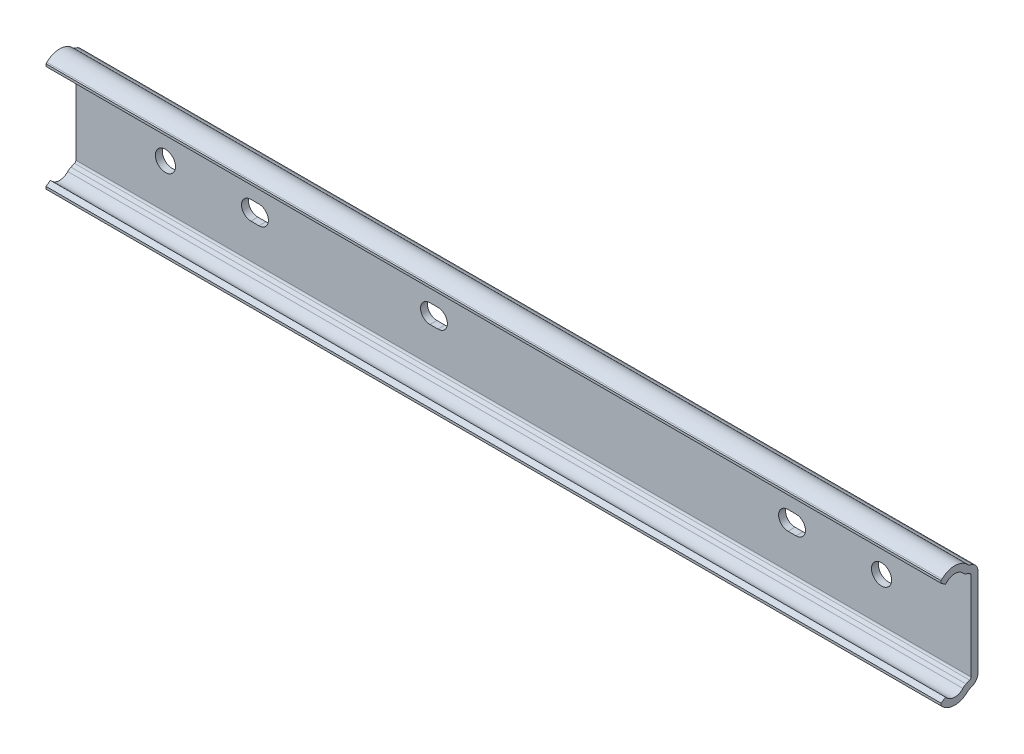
ISO-10303-21;
HEADER;
FILE_DESCRIPTION(('STEP AP214'),'2;1');
FILE_NAME('part.step','',(''),(''),'','','');
FILE_SCHEMA(('AUTOMOTIVE_DESIGN { 1 0 10303 214 1 1 1 1 }'));
ENDSEC;
DATA;
#1=APPLICATION_CONTEXT('core data for automotive mechanical design processes');
#2=APPLICATION_PROTOCOL_DEFINITION('international standard','automotive_design',2000,#1);
#3=PRODUCT_CONTEXT('',#1,'mechanical');
#4=PRODUCT('Part','Part','',(#3));
#5=PRODUCT_RELATED_PRODUCT_CATEGORY('part','',(#4));
#6=PRODUCT_DEFINITION_FORMATION('','',#4);
#7=PRODUCT_DEFINITION_CONTEXT('part definition',#1,'design');
#8=PRODUCT_DEFINITION('design','',#6,#7);
#9=PRODUCT_DEFINITION_SHAPE('','',#8);
#10=(LENGTH_UNIT() NAMED_UNIT(*) SI_UNIT(.MILLI.,.METRE.));
#11=(NAMED_UNIT(*) PLANE_ANGLE_UNIT() SI_UNIT($,.RADIAN.));
#12=(NAMED_UNIT(*) SI_UNIT($,.STERADIAN.) SOLID_ANGLE_UNIT());
#13=UNCERTAINTY_MEASURE_WITH_UNIT(LENGTH_MEASURE(1.E-05),#10,'distance_accuracy_value','');
#14=(GEOMETRIC_REPRESENTATION_CONTEXT(3) GLOBAL_UNCERTAINTY_ASSIGNED_CONTEXT((#13)) GLOBAL_UNIT_ASSIGNED_CONTEXT((#10,
#11,#12)) REPRESENTATION_CONTEXT('',''));
#15=CARTESIAN_POINT('',(0.,0.,0.));
#16=DIRECTION('',(0.,0.,1.));
#17=DIRECTION('',(1.,0.,0.));
#18=AXIS2_PLACEMENT_3D('',#15,#16,#17);
#19=CARTESIAN_POINT('',(-20.,9.85313395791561,1.54999999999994));
#20=DIRECTION('',(0.,0.,1.));
#21=DIRECTION('',(-1.,0.,0.));
#22=AXIS2_PLACEMENT_3D('',#19,#20,#21);
#23=PLANE('',#22);
#24=DIRECTION('',(0.,-1.,0.));
#25=VECTOR('',#24,1.);
#26=CARTESIAN_POINT('',(-20.,9.85313395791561,1.54999999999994));
#27=LINE('',#26,#25);
#28=CARTESIAN_POINT('',(-20.,9.85313395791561,1.54999999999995));
#29=VERTEX_POINT('',#28);
#30=CARTESIAN_POINT('',(-20.,-9.85313395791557,1.54999999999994));
#31=VERTEX_POINT('',#30);
#32=EDGE_CURVE('E510',#29,#31,#27,.T.);
#33=ORIENTED_EDGE('',*,*,#32,.T.);
#34=DIRECTION('',(1.,0.,0.));
#35=VECTOR('',#34,1.);
#36=CARTESIAN_POINT('',(-20.,-9.85313395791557,1.54999999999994));
#37=LINE('',#36,#35);
#38=CARTESIAN_POINT('',(180.,-9.85313395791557,1.54999999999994));
#39=VERTEX_POINT('',#38);
#40=EDGE_CURVE('E524',#31,#39,#37,.T.);
#41=ORIENTED_EDGE('',*,*,#40,.T.);
#42=DIRECTION('',(0.,-1.,0.));
#43=VECTOR('',#42,1.);
#44=CARTESIAN_POINT('',(180.,9.85313395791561,1.54999999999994));
#45=LINE('',#44,#43);
#46=CARTESIAN_POINT('',(180.,9.85313395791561,1.54999999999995));
#47=VERTEX_POINT('',#46);
#48=EDGE_CURVE('E435',#47,#39,#45,.T.);
#49=ORIENTED_EDGE('',*,*,#48,.F.);
#50=DIRECTION('',(1.,0.,0.));
#51=VECTOR('',#50,1.);
#52=CARTESIAN_POINT('',(-20.,9.85313395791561,1.54999999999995));
#53=LINE('',#52,#51);
#54=EDGE_CURVE('E526',#29,#47,#53,.T.);
#55=ORIENTED_EDGE('',*,*,#54,.F.);
#56=EDGE_LOOP('',(#33,#41,#49,#55));
#57=FACE_BOUND('',#56,.T.);
#58=CARTESIAN_POINT('',(20.9,0.,1.54999999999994));
#59=DIRECTION('',(0.,0.,1.));
#60=DIRECTION('',(-1.,0.,0.));
#61=AXIS2_PLACEMENT_3D('',#58,#59,#60);
#62=CIRCLE('',#61,2.1);
#63=CARTESIAN_POINT('',(20.9,-2.1,1.54999999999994));
#64=VERTEX_POINT('',#63);
#65=CARTESIAN_POINT('',(20.9,2.1,1.54999999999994));
#66=VERTEX_POINT('',#65);
#67=EDGE_CURVE('E31',#64,#66,#62,.T.);
#68=ORIENTED_EDGE('',*,*,#67,.F.);
#69=DIRECTION('',(1.,0.,0.));
#70=VECTOR('',#69,1.);
#71=CARTESIAN_POINT('',(20.9,-2.1,1.54999999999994));
#72=LINE('',#71,#70);
#73=CARTESIAN_POINT('',(19.1,-2.1,1.54999999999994));
#74=VERTEX_POINT('',#73);
#75=EDGE_CURVE('E277',#74,#64,#72,.T.);
#76=ORIENTED_EDGE('',*,*,#75,.F.);
#77=CARTESIAN_POINT('',(19.1,0.,1.54999999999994));
#78=DIRECTION('',(0.,0.,1.));
#79=DIRECTION('',(-1.,0.,0.));
#80=AXIS2_PLACEMENT_3D('',#77,#78,#79);
#81=CIRCLE('',#80,2.1);
#82=CARTESIAN_POINT('',(19.1,2.1,1.54999999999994));
#83=VERTEX_POINT('',#82);
#84=EDGE_CURVE('E262',#83,#74,#81,.T.);
#85=ORIENTED_EDGE('',*,*,#84,.F.);
#86=DIRECTION('',(-1.,0.,0.));
#87=VECTOR('',#86,1.);
#88=CARTESIAN_POINT('',(20.9,2.1,1.54999999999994));
#89=LINE('',#88,#87);
#90=EDGE_CURVE('E271',#66,#83,#89,.T.);
#91=ORIENTED_EDGE('',*,*,#90,.F.);
#92=EDGE_LOOP('',(#68,#76,#85,#91));
#93=FACE_BOUND('',#92,.T.);
#94=CARTESIAN_POINT('',(60.9,0.,1.54999999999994));
#95=DIRECTION('',(0.,0.,1.));
#96=DIRECTION('',(-1.,0.,0.));
#97=AXIS2_PLACEMENT_3D('',#94,#95,#96);
#98=CIRCLE('',#97,2.1);
#99=CARTESIAN_POINT('',(60.9,-2.1,1.54999999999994));
#100=VERTEX_POINT('',#99);
#101=CARTESIAN_POINT('',(60.9,2.1,1.54999999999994));
#102=VERTEX_POINT('',#101);
#103=EDGE_CURVE('E293',#100,#102,#98,.T.);
#104=ORIENTED_EDGE('',*,*,#103,.F.);
#105=DIRECTION('',(1.,0.,0.));
#106=VECTOR('',#105,1.);
#107=CARTESIAN_POINT('',(60.9,-2.1,1.54999999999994));
#108=LINE('',#107,#106);
#109=CARTESIAN_POINT('',(59.1,-2.1,1.54999999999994));
#110=VERTEX_POINT('',#109);
#111=EDGE_CURVE('E303',#110,#100,#108,.T.);
#112=ORIENTED_EDGE('',*,*,#111,.F.);
#113=CARTESIAN_POINT('',(59.1,0.,1.54999999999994));
#114=DIRECTION('',(0.,0.,1.));
#115=DIRECTION('',(-1.,0.,0.));
#116=AXIS2_PLACEMENT_3D('',#113,#114,#115);
#117=CIRCLE('',#116,2.1);
#118=CARTESIAN_POINT('',(59.1,2.1,1.54999999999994));
#119=VERTEX_POINT('',#118);
#120=EDGE_CURVE('E300',#119,#110,#117,.T.);
#121=ORIENTED_EDGE('',*,*,#120,.F.);
#122=DIRECTION('',(-1.,0.,0.));
#123=VECTOR('',#122,1.);
#124=CARTESIAN_POINT('',(60.9,2.1,1.54999999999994));
#125=LINE('',#124,#123);
#126=EDGE_CURVE('E297',#102,#119,#125,.T.);
#127=ORIENTED_EDGE('',*,*,#126,.F.);
#128=EDGE_LOOP('',(#104,#112,#121,#127));
#129=FACE_BOUND('',#128,.T.);
#130=CARTESIAN_POINT('',(160.,0.,1.54999999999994));
#131=DIRECTION('',(0.,0.,1.));
#132=DIRECTION('',(-1.,0.,0.));
#133=AXIS2_PLACEMENT_3D('',#130,#131,#132);
#134=CIRCLE('',#133,2.24999999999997);
#135=CARTESIAN_POINT('',(157.75,0.,1.54999999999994));
#136=VERTEX_POINT('',#135);
#137=EDGE_CURVE('E321',#136,#136,#134,.T.);
#138=ORIENTED_EDGE('',*,*,#137,.F.);
#139=EDGE_LOOP('',(#138));
#140=FACE_BOUND('',#139,.T.);
#141=CARTESIAN_POINT('',(0.,0.,1.54999999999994));
#142=DIRECTION('',(0.,0.,1.));
#143=DIRECTION('',(-1.,0.,0.));
#144=AXIS2_PLACEMENT_3D('',#141,#142,#143);
#145=CIRCLE('',#144,2.25);
#146=CARTESIAN_POINT('',(-2.25,0.,1.54999999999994));
#147=VERTEX_POINT('',#146);
#148=EDGE_CURVE('E333',#147,#147,#145,.T.);
#149=ORIENTED_EDGE('',*,*,#148,.F.);
#150=EDGE_LOOP('',(#149));
#151=FACE_BOUND('',#150,.T.);
#152=CARTESIAN_POINT('',(139.1,0.,1.54999999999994));
#153=DIRECTION('',(0.,0.,1.));
#154=DIRECTION('',(-1.,0.,0.));
#155=AXIS2_PLACEMENT_3D('',#152,#153,#154);
#156=CIRCLE('',#155,2.1);
#157=CARTESIAN_POINT('',(139.1,2.1,1.54999999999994));
#158=VERTEX_POINT('',#157);
#159=CARTESIAN_POINT('',(139.1,-2.1,1.54999999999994));
#160=VERTEX_POINT('',#159);
#161=EDGE_CURVE('E339',#158,#160,#156,.T.);
#162=ORIENTED_EDGE('',*,*,#161,.F.);
#163=DIRECTION('',(-1.,0.,0.));
#164=VECTOR('',#163,1.);
#165=CARTESIAN_POINT('',(140.9,2.1,1.54999999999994));
#166=LINE('',#165,#164);
#167=CARTESIAN_POINT('',(140.9,2.1,1.54999999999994));
#168=VERTEX_POINT('',#167);
#169=EDGE_CURVE('E347',#168,#158,#166,.T.);
#170=ORIENTED_EDGE('',*,*,#169,.F.);
#171=CARTESIAN_POINT('',(140.9,0.,1.54999999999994));
#172=DIRECTION('',(0.,0.,1.));
#173=DIRECTION('',(-1.,0.,0.));
#174=AXIS2_PLACEMENT_3D('',#171,#172,#173);
#175=CIRCLE('',#174,2.1);
#176=CARTESIAN_POINT('',(140.9,-2.1,1.54999999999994));
#177=VERTEX_POINT('',#176);
#178=EDGE_CURVE('E344',#177,#168,#175,.T.);
#179=ORIENTED_EDGE('',*,*,#178,.F.);
#180=DIRECTION('',(1.,0.,0.));
#181=VECTOR('',#180,1.);
#182=CARTESIAN_POINT('',(140.9,-2.1,1.54999999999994));
#183=LINE('',#182,#181);
#184=EDGE_CURVE('E341',#160,#177,#183,.T.);
#185=ORIENTED_EDGE('',*,*,#184,.F.);
#186=EDGE_LOOP('',(#162,#170,#179,#185));
#187=FACE_BOUND('',#186,.T.);
#188=ADVANCED_FACE('F14',(#57,#93,#129,#140,#151,#187),#23,.T.);
#189=CARTESIAN_POINT('',(-20.,9.85313395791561,0.));
#190=DIRECTION('',(0.,0.,-1.));
#191=DIRECTION('',(1.,0.,0.));
#192=AXIS2_PLACEMENT_3D('',#189,#190,#191);
#193=PLANE('',#192);
#194=DIRECTION('',(0.,1.,0.));
#195=VECTOR('',#194,1.);
#196=CARTESIAN_POINT('',(-20.,9.85313395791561,0.));
#197=LINE('',#196,#195);
#198=CARTESIAN_POINT('',(-20.,-9.85313395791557,0.));
#199=VERTEX_POINT('',#198);
#200=CARTESIAN_POINT('',(-20.,9.85313395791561,0.));
#201=VERTEX_POINT('',#200);
#202=EDGE_CURVE('E473',#199,#201,#197,.T.);
#203=ORIENTED_EDGE('',*,*,#202,.T.);
#204=DIRECTION('',(1.,0.,0.));
#205=VECTOR('',#204,1.);
#206=CARTESIAN_POINT('',(-20.,9.85313395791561,0.));
#207=LINE('',#206,#205);
#208=CARTESIAN_POINT('',(180.,9.85313395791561,0.));
#209=VERTEX_POINT('',#208);
#210=EDGE_CURVE('E551',#201,#209,#207,.T.);
#211=ORIENTED_EDGE('',*,*,#210,.T.);
#212=DIRECTION('',(0.,1.,0.));
#213=VECTOR('',#212,1.);
#214=CARTESIAN_POINT('',(180.,9.85313395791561,0.));
#215=LINE('',#214,#213);
#216=CARTESIAN_POINT('',(180.,-9.85313395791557,0.));
#217=VERTEX_POINT('',#216);
#218=EDGE_CURVE('E397',#217,#209,#215,.T.);
#219=ORIENTED_EDGE('',*,*,#218,.F.);
#220=DIRECTION('',(1.,0.,0.));
#221=VECTOR('',#220,1.);
#222=CARTESIAN_POINT('',(-20.,-9.85313395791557,0.));
#223=LINE('',#222,#221);
#224=EDGE_CURVE('E553',#199,#217,#223,.T.);
#225=ORIENTED_EDGE('',*,*,#224,.F.);
#226=EDGE_LOOP('',(#203,#211,#219,#225));
#227=FACE_BOUND('',#226,.T.);
#228=CARTESIAN_POINT('',(20.9,0.,0.));
#229=DIRECTION('',(0.,0.,1.));
#230=DIRECTION('',(-1.,0.,0.));
#231=AXIS2_PLACEMENT_3D('',#228,#229,#230);
#232=CIRCLE('',#231,2.1);
#233=CARTESIAN_POINT('',(20.9,-2.1,0.));
#234=VERTEX_POINT('',#233);
#235=CARTESIAN_POINT('',(20.9,2.1,0.));
#236=VERTEX_POINT('',#235);
#237=EDGE_CURVE('E279',#234,#236,#232,.T.);
#238=ORIENTED_EDGE('',*,*,#237,.T.);
#239=DIRECTION('',(-1.,0.,0.));
#240=VECTOR('',#239,1.);
#241=CARTESIAN_POINT('',(20.9,2.1,0.));
#242=LINE('',#241,#240);
#243=CARTESIAN_POINT('',(19.1,2.1,0.));
#244=VERTEX_POINT('',#243);
#245=EDGE_CURVE('E285',#236,#244,#242,.T.);
#246=ORIENTED_EDGE('',*,*,#245,.T.);
#247=CARTESIAN_POINT('',(19.1,0.,0.));
#248=DIRECTION('',(0.,0.,1.));
#249=DIRECTION('',(-1.,0.,0.));
#250=AXIS2_PLACEMENT_3D('',#247,#248,#249);
#251=CIRCLE('',#250,2.1);
#252=CARTESIAN_POINT('',(19.1,-2.1,0.));
#253=VERTEX_POINT('',#252);
#254=EDGE_CURVE('E39',#244,#253,#251,.T.);
#255=ORIENTED_EDGE('',*,*,#254,.T.);
#256=DIRECTION('',(1.,0.,0.));
#257=VECTOR('',#256,1.);
#258=CARTESIAN_POINT('',(20.9,-2.1,0.));
#259=LINE('',#258,#257);
#260=EDGE_CURVE('E288',#253,#234,#259,.T.);
#261=ORIENTED_EDGE('',*,*,#260,.T.);
#262=EDGE_LOOP('',(#238,#246,#255,#261));
#263=FACE_BOUND('',#262,.T.);
#264=CARTESIAN_POINT('',(60.9,0.,0.));
#265=DIRECTION('',(0.,0.,1.));
#266=DIRECTION('',(-1.,0.,0.));
#267=AXIS2_PLACEMENT_3D('',#264,#265,#266);
#268=CIRCLE('',#267,2.1);
#269=CARTESIAN_POINT('',(60.9,-2.1,0.));
#270=VERTEX_POINT('',#269);
#271=CARTESIAN_POINT('',(60.9,2.1,0.));
#272=VERTEX_POINT('',#271);
#273=EDGE_CURVE('E306',#270,#272,#268,.T.);
#274=ORIENTED_EDGE('',*,*,#273,.T.);
#275=DIRECTION('',(-1.,0.,0.));
#276=VECTOR('',#275,1.);
#277=CARTESIAN_POINT('',(60.9,2.1,0.));
#278=LINE('',#277,#276);
#279=CARTESIAN_POINT('',(59.1,2.1,0.));
#280=VERTEX_POINT('',#279);
#281=EDGE_CURVE('E309',#272,#280,#278,.T.);
#282=ORIENTED_EDGE('',*,*,#281,.T.);
#283=CARTESIAN_POINT('',(59.1,0.,0.));
#284=DIRECTION('',(0.,0.,1.));
#285=DIRECTION('',(-1.,0.,0.));
#286=AXIS2_PLACEMENT_3D('',#283,#284,#285);
#287=CIRCLE('',#286,2.1);
#288=CARTESIAN_POINT('',(59.1,-2.1,0.));
#289=VERTEX_POINT('',#288);
#290=EDGE_CURVE('E312',#280,#289,#287,.T.);
#291=ORIENTED_EDGE('',*,*,#290,.T.);
#292=DIRECTION('',(1.,0.,0.));
#293=VECTOR('',#292,1.);
#294=CARTESIAN_POINT('',(60.9,-2.1,0.));
#295=LINE('',#294,#293);
#296=EDGE_CURVE('E315',#289,#270,#295,.T.);
#297=ORIENTED_EDGE('',*,*,#296,.T.);
#298=EDGE_LOOP('',(#274,#282,#291,#297));
#299=FACE_BOUND('',#298,.T.);
#300=CARTESIAN_POINT('',(160.,0.,0.));
#301=DIRECTION('',(0.,0.,1.));
#302=DIRECTION('',(-1.,0.,0.));
#303=AXIS2_PLACEMENT_3D('',#300,#301,#302);
#304=CIRCLE('',#303,2.24999999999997);
#305=CARTESIAN_POINT('',(157.75,0.,0.));
#306=VERTEX_POINT('',#305);
#307=EDGE_CURVE('E330',#306,#306,#304,.T.);
#308=ORIENTED_EDGE('',*,*,#307,.T.);
#309=EDGE_LOOP('',(#308));
#310=FACE_BOUND('',#309,.T.);
#311=CARTESIAN_POINT('',(0.,0.,0.));
#312=DIRECTION('',(0.,0.,1.));
#313=DIRECTION('',(-1.,0.,0.));
#314=AXIS2_PLACEMENT_3D('',#311,#312,#313);
#315=CIRCLE('',#314,2.25);
#316=CARTESIAN_POINT('',(-2.25,0.,0.));
#317=VERTEX_POINT('',#316);
#318=EDGE_CURVE('E336',#317,#317,#315,.T.);
#319=ORIENTED_EDGE('',*,*,#318,.T.);
#320=EDGE_LOOP('',(#319));
#321=FACE_BOUND('',#320,.T.);
#322=CARTESIAN_POINT('',(139.1,0.,0.));
#323=DIRECTION('',(0.,0.,1.));
#324=DIRECTION('',(-1.,0.,0.));
#325=AXIS2_PLACEMENT_3D('',#322,#323,#324);
#326=CIRCLE('',#325,2.1);
#327=CARTESIAN_POINT('',(139.1,2.1,0.));
#328=VERTEX_POINT('',#327);
#329=CARTESIAN_POINT('',(139.1,-2.1,0.));
#330=VERTEX_POINT('',#329);
#331=EDGE_CURVE('E350',#328,#330,#326,.T.);
#332=ORIENTED_EDGE('',*,*,#331,.T.);
#333=DIRECTION('',(1.,0.,0.));
#334=VECTOR('',#333,1.);
#335=CARTESIAN_POINT('',(140.9,-2.1,0.));
#336=LINE('',#335,#334);
#337=CARTESIAN_POINT('',(140.9,-2.1,0.));
#338=VERTEX_POINT('',#337);
#339=EDGE_CURVE('E353',#330,#338,#336,.T.);
#340=ORIENTED_EDGE('',*,*,#339,.T.);
#341=CARTESIAN_POINT('',(140.9,0.,0.));
#342=DIRECTION('',(0.,0.,1.));
#343=DIRECTION('',(-1.,0.,0.));
#344=AXIS2_PLACEMENT_3D('',#341,#342,#343);
#345=CIRCLE('',#344,2.1);
#346=CARTESIAN_POINT('',(140.9,2.1,0.));
#347=VERTEX_POINT('',#346);
#348=EDGE_CURVE('E356',#338,#347,#345,.T.);
#349=ORIENTED_EDGE('',*,*,#348,.T.);
#350=DIRECTION('',(-1.,0.,0.));
#351=VECTOR('',#350,1.);
#352=CARTESIAN_POINT('',(140.9,2.1,0.));
#353=LINE('',#352,#351);
#354=EDGE_CURVE('E359',#347,#328,#353,.T.);
#355=ORIENTED_EDGE('',*,*,#354,.T.);
#356=EDGE_LOOP('',(#332,#340,#349,#355));
#357=FACE_BOUND('',#356,.T.);
#358=ADVANCED_FACE('F618',(#227,#263,#299,#310,#321,#357),#193,.T.);
#359=CARTESIAN_POINT('',(-20.,-9.46999976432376,5.19000022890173));
#360=DIRECTION('',(1.,0.,0.));
#361=DIRECTION('',(0.,0.,1.));
#362=AXIS2_PLACEMENT_3D('',#359,#360,#361);
#363=CYLINDRICAL_SURFACE('',#362,2.47999999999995);
#364=CARTESIAN_POINT('',(180.,-9.46999976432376,5.19000022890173));
#365=DIRECTION('',(-1.,0.,0.));
#366=DIRECTION('',(0.,0.,1.));
#367=AXIS2_PLACEMENT_3D('',#364,#365,#366);
#368=CIRCLE('',#367,2.47999999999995);
#369=CARTESIAN_POINT('',(180.,-11.1527317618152,3.3682392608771));
#370=VERTEX_POINT('',#369);
#371=CARTESIAN_POINT('',(180.,-11.2236245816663,6.94362504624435));
#372=VERTEX_POINT('',#371);
#373=EDGE_CURVE('E365',#370,#372,#368,.T.);
#374=ORIENTED_EDGE('',*,*,#373,.F.);
#375=DIRECTION('',(1.,0.,0.));
#376=VECTOR('',#375,1.);
#377=CARTESIAN_POINT('',(-20.,-11.1527317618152,3.3682392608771));
#378=LINE('',#377,#376);
#379=CARTESIAN_POINT('',(-20.,-11.1527317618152,3.3682392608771));
#380=VERTEX_POINT('',#379);
#381=EDGE_CURVE('E9',#380,#370,#378,.T.);
#382=ORIENTED_EDGE('',*,*,#381,.F.);
#383=CARTESIAN_POINT('',(-20.,-9.46999976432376,5.19000022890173));
#384=DIRECTION('',(-1.,0.,0.));
#385=DIRECTION('',(0.,0.,1.));
#386=AXIS2_PLACEMENT_3D('',#383,#384,#385);
#387=CIRCLE('',#386,2.47999999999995);
#388=CARTESIAN_POINT('',(-20.,-11.2236245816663,6.94362504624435));
#389=VERTEX_POINT('',#388);
#390=EDGE_CURVE('E447',#380,#389,#387,.T.);
#391=ORIENTED_EDGE('',*,*,#390,.T.);
#392=DIRECTION('',(1.,0.,0.));
#393=VECTOR('',#392,1.);
#394=CARTESIAN_POINT('',(-20.,-11.2236245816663,6.94362504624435));
#395=LINE('',#394,#393);
#396=EDGE_CURVE('E18',#389,#372,#395,.T.);
#397=ORIENTED_EDGE('',*,*,#396,.T.);
#398=EDGE_LOOP('',(#374,#382,#391,#397));
#399=FACE_BOUND('',#398,.T.);
#400=ADVANCED_FACE('F16',(#399),#363,.F.);
#401=CARTESIAN_POINT('',(-20.,-12.5436997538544,1.86234824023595));
#402=DIRECTION('',(1.,0.,0.));
#403=DIRECTION('',(0.,0.,1.));
#404=AXIS2_PLACEMENT_3D('',#401,#402,#403);
#405=CYLINDRICAL_SURFACE('',#404,2.04999993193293);
#406=CARTESIAN_POINT('',(180.,-12.5436997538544,1.86234824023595));
#407=DIRECTION('',(1.,0.,0.));
#408=DIRECTION('',(0.,0.,1.));
#409=AXIS2_PLACEMENT_3D('',#406,#407,#408);
#410=CIRCLE('',#409,2.04999993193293);
#411=CARTESIAN_POINT('',(180.,-10.6566648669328,2.66334702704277));
#412=VERTEX_POINT('',#411);
#413=EDGE_CURVE('E444',#412,#370,#410,.T.);
#414=ORIENTED_EDGE('',*,*,#413,.F.);
#415=DIRECTION('',(1.,0.,0.));
#416=VECTOR('',#415,1.);
#417=CARTESIAN_POINT('',(-20.,-10.6566648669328,2.66334702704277));
#418=LINE('',#417,#416);
#419=CARTESIAN_POINT('',(-20.,-10.6566648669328,2.66334702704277));
#420=VERTEX_POINT('',#419);
#421=EDGE_CURVE('E23',#420,#412,#418,.T.);
#422=ORIENTED_EDGE('',*,*,#421,.F.);
#423=CARTESIAN_POINT('',(-20.,-12.5436997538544,1.86234824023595));
#424=DIRECTION('',(1.,0.,0.));
#425=DIRECTION('',(0.,0.,1.));
#426=AXIS2_PLACEMENT_3D('',#423,#424,#425);
#427=CIRCLE('',#426,2.04999993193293);
#428=EDGE_CURVE('E518',#420,#380,#427,.T.);
#429=ORIENTED_EDGE('',*,*,#428,.T.);
#430=ORIENTED_EDGE('',*,*,#381,.T.);
#431=EDGE_LOOP('',(#414,#422,#429,#430));
#432=FACE_BOUND('',#431,.T.);
#433=ADVANCED_FACE('F581',(#432),#405,.T.);
#434=CARTESIAN_POINT('',(-20.,-10.6566648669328,2.66334702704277));
#435=DIRECTION('',(0.,0.920504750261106,0.390731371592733));
#436=DIRECTION('',(0.,-0.390731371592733,0.920504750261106));
#437=AXIS2_PLACEMENT_3D('',#434,#435,#436);
#438=PLANE('',#437);
#439=DIRECTION('',(0.,-0.390731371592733,0.920504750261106));
#440=VECTOR('',#439,1.);
#441=CARTESIAN_POINT('',(180.,-10.6566648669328,2.66334702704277));
#442=LINE('',#441,#440);
#443=CARTESIAN_POINT('',(180.,-10.3133868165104,1.85463521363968));
#444=VERTEX_POINT('',#443);
#445=EDGE_CURVE('E441',#444,#412,#442,.T.);
#446=ORIENTED_EDGE('',*,*,#445,.F.);
#447=DIRECTION('',(1.,0.,0.));
#448=VECTOR('',#447,1.);
#449=CARTESIAN_POINT('',(-20.,-10.3133868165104,1.85463521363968));
#450=LINE('',#449,#448);
#451=CARTESIAN_POINT('',(-20.,-10.3133868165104,1.85463521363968));
#452=VERTEX_POINT('',#451);
#453=EDGE_CURVE('E522',#452,#444,#450,.T.);
#454=ORIENTED_EDGE('',*,*,#453,.F.);
#455=DIRECTION('',(0.,-0.390731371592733,0.920504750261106));
#456=VECTOR('',#455,1.);
#457=CARTESIAN_POINT('',(-20.,-10.6566648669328,2.66334702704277));
#458=LINE('',#457,#456);
#459=EDGE_CURVE('E515',#452,#420,#458,.T.);
#460=ORIENTED_EDGE('',*,*,#459,.T.);
#461=ORIENTED_EDGE('',*,*,#421,.T.);
#462=EDGE_LOOP('',(#446,#454,#460,#461));
#463=FACE_BOUND('',#462,.T.);
#464=ADVANCED_FACE('F678',(#463),#438,.T.);
#465=CARTESIAN_POINT('',(-20.,-9.85313395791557,2.05000015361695));
#466=DIRECTION('',(1.,0.,0.));
#467=DIRECTION('',(0.,0.,1.));
#468=AXIS2_PLACEMENT_3D('',#465,#466,#467);
#469=CYLINDRICAL_SURFACE('',#468,0.500000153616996);
#470=CARTESIAN_POINT('',(180.,-9.85313395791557,2.05000015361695));
#471=DIRECTION('',(-1.,0.,0.));
#472=DIRECTION('',(0.,0.,1.));
#473=AXIS2_PLACEMENT_3D('',#470,#471,#472);
#474=CIRCLE('',#473,0.500000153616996);
#475=EDGE_CURVE('E438',#39,#444,#474,.T.);
#476=ORIENTED_EDGE('',*,*,#475,.F.);
#477=ORIENTED_EDGE('',*,*,#40,.F.);
#478=CARTESIAN_POINT('',(-20.,-9.85313395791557,2.05000015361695));
#479=DIRECTION('',(-1.,0.,0.));
#480=DIRECTION('',(0.,0.,1.));
#481=AXIS2_PLACEMENT_3D('',#478,#479,#480);
#482=CIRCLE('',#481,0.500000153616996);
#483=EDGE_CURVE('E512',#31,#452,#482,.T.);
#484=ORIENTED_EDGE('',*,*,#483,.T.);
#485=ORIENTED_EDGE('',*,*,#453,.T.);
#486=EDGE_LOOP('',(#476,#477,#484,#485));
#487=FACE_BOUND('',#486,.T.);
#488=ADVANCED_FACE('F676',(#487),#469,.F.);
#489=CARTESIAN_POINT('',(-20.,9.85313395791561,2.05000015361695));
#490=DIRECTION('',(1.,0.,0.));
#491=DIRECTION('',(0.,0.,1.));
#492=AXIS2_PLACEMENT_3D('',#489,#490,#491);
#493=CYLINDRICAL_SURFACE('',#492,0.500000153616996);
#494=CARTESIAN_POINT('',(180.,9.85313395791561,2.05000015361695));
#495=DIRECTION('',(-1.,0.,0.));
#496=DIRECTION('',(0.,0.,-1.));
#497=AXIS2_PLACEMENT_3D('',#494,#495,#496);
#498=CIRCLE('',#497,0.500000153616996);
#499=CARTESIAN_POINT('',(180.,10.3133868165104,1.85463521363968));
#500=VERTEX_POINT('',#499);
#501=EDGE_CURVE('E432',#500,#47,#498,.T.);
#502=ORIENTED_EDGE('',*,*,#501,.F.);
#503=DIRECTION('',(1.,0.,0.));
#504=VECTOR('',#503,1.);
#505=CARTESIAN_POINT('',(-20.,10.3133868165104,1.85463521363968));
#506=LINE('',#505,#504);
#507=CARTESIAN_POINT('',(-20.,10.3133868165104,1.85463521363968));
#508=VERTEX_POINT('',#507);
#509=EDGE_CURVE('E528',#508,#500,#506,.T.);
#510=ORIENTED_EDGE('',*,*,#509,.F.);
#511=CARTESIAN_POINT('',(-20.,9.85313395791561,2.05000015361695));
#512=DIRECTION('',(-1.,0.,0.));
#513=DIRECTION('',(0.,0.,-1.));
#514=AXIS2_PLACEMENT_3D('',#511,#512,#513);
#515=CIRCLE('',#514,0.500000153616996);
#516=EDGE_CURVE('E507',#508,#29,#515,.T.);
#517=ORIENTED_EDGE('',*,*,#516,.T.);
#518=ORIENTED_EDGE('',*,*,#54,.T.);
#519=EDGE_LOOP('',(#502,#510,#517,#518));
#520=FACE_BOUND('',#519,.T.);
#521=ADVANCED_FACE('F668',(#520),#493,.F.);
#522=CARTESIAN_POINT('',(-20.,10.6566648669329,2.66334702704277));
#523=DIRECTION('',(0.,-0.920504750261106,0.390731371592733));
#524=DIRECTION('',(0.,-0.390731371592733,-0.920504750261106));
#525=AXIS2_PLACEMENT_3D('',#522,#523,#524);
#526=PLANE('',#525);
#527=DIRECTION('',(0.,-0.390731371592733,-0.920504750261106));
#528=VECTOR('',#527,1.);
#529=CARTESIAN_POINT('',(180.,10.6566648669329,2.66334702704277));
#530=LINE('',#529,#528);
#531=CARTESIAN_POINT('',(180.,10.6566648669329,2.66334702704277));
#532=VERTEX_POINT('',#531);
#533=EDGE_CURVE('E429',#532,#500,#530,.T.);
#534=ORIENTED_EDGE('',*,*,#533,.F.);
#535=DIRECTION('',(1.,0.,0.));
#536=VECTOR('',#535,1.);
#537=CARTESIAN_POINT('',(-20.,10.6566648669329,2.66334702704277));
#538=LINE('',#537,#536);
#539=CARTESIAN_POINT('',(-20.,10.6566648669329,2.66334702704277));
#540=VERTEX_POINT('',#539);
#541=EDGE_CURVE('E530',#540,#532,#538,.T.);
#542=ORIENTED_EDGE('',*,*,#541,.F.);
#543=DIRECTION('',(0.,-0.390731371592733,-0.920504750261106));
#544=VECTOR('',#543,1.);
#545=CARTESIAN_POINT('',(-20.,10.6566648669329,2.66334702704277));
#546=LINE('',#545,#544);
#547=EDGE_CURVE('E504',#540,#508,#546,.T.);
#548=ORIENTED_EDGE('',*,*,#547,.T.);
#549=ORIENTED_EDGE('',*,*,#509,.T.);
#550=EDGE_LOOP('',(#534,#542,#548,#549));
#551=FACE_BOUND('',#550,.T.);
#552=ADVANCED_FACE('F664',(#551),#526,.T.);
#553=CARTESIAN_POINT('',(-20.,12.5436997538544,1.86234824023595));
#554=DIRECTION('',(1.,0.,0.));
#555=DIRECTION('',(0.,0.,1.));
#556=AXIS2_PLACEMENT_3D('',#553,#554,#555);
#557=CYLINDRICAL_SURFACE('',#556,2.04999993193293);
#558=CARTESIAN_POINT('',(180.,12.5436997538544,1.86234824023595));
#559=DIRECTION('',(1.,0.,0.));
#560=DIRECTION('',(0.,0.,-1.));
#561=AXIS2_PLACEMENT_3D('',#558,#559,#560);
#562=CIRCLE('',#561,2.04999993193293);
#563=CARTESIAN_POINT('',(180.,11.1527317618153,3.36823926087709));
#564=VERTEX_POINT('',#563);
#565=EDGE_CURVE('E426',#564,#532,#562,.T.);
#566=ORIENTED_EDGE('',*,*,#565,.F.);
#567=DIRECTION('',(1.,0.,0.));
#568=VECTOR('',#567,1.);
#569=CARTESIAN_POINT('',(-20.,11.1527317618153,3.36823926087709));
#570=LINE('',#569,#568);
#571=CARTESIAN_POINT('',(-20.,11.1527317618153,3.36823926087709));
#572=VERTEX_POINT('',#571);
#573=EDGE_CURVE('E532',#572,#564,#570,.T.);
#574=ORIENTED_EDGE('',*,*,#573,.F.);
#575=CARTESIAN_POINT('',(-20.,12.5436997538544,1.86234824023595));
#576=DIRECTION('',(1.,0.,0.));
#577=DIRECTION('',(0.,0.,-1.));
#578=AXIS2_PLACEMENT_3D('',#575,#576,#577);
#579=CIRCLE('',#578,2.04999993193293);
#580=EDGE_CURVE('E501',#572,#540,#579,.T.);
#581=ORIENTED_EDGE('',*,*,#580,.T.);
#582=ORIENTED_EDGE('',*,*,#541,.T.);
#583=EDGE_LOOP('',(#566,#574,#581,#582));
#584=FACE_BOUND('',#583,.T.);
#585=ADVANCED_FACE('F660',(#584),#557,.T.);
#586=CARTESIAN_POINT('',(-20.,9.4699997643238,5.19000022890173));
#587=DIRECTION('',(1.,0.,0.));
#588=DIRECTION('',(0.,0.,1.));
#589=AXIS2_PLACEMENT_3D('',#586,#587,#588);
#590=CYLINDRICAL_SURFACE('',#589,2.47999999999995);
#591=CARTESIAN_POINT('',(180.,9.4699997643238,5.19000022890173));
#592=DIRECTION('',(-1.,0.,0.));
#593=DIRECTION('',(0.,0.,-1.));
#594=AXIS2_PLACEMENT_3D('',#591,#592,#593);
#595=CIRCLE('',#594,2.47999999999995);
#596=CARTESIAN_POINT('',(180.,11.2236245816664,6.94362504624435));
#597=VERTEX_POINT('',#596);
#598=EDGE_CURVE('E423',#597,#564,#595,.T.);
#599=ORIENTED_EDGE('',*,*,#598,.F.);
#600=DIRECTION('',(1.,0.,0.));
#601=VECTOR('',#600,1.);
#602=CARTESIAN_POINT('',(-20.,11.2236245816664,6.94362504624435));
#603=LINE('',#602,#601);
#604=CARTESIAN_POINT('',(-20.,11.2236245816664,6.94362504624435));
#605=VERTEX_POINT('',#604);
#606=EDGE_CURVE('E534',#605,#597,#603,.T.);
#607=ORIENTED_EDGE('',*,*,#606,.F.);
#608=CARTESIAN_POINT('',(-20.,9.4699997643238,5.19000022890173));
#609=DIRECTION('',(-1.,0.,0.));
#610=DIRECTION('',(0.,0.,-1.));
#611=AXIS2_PLACEMENT_3D('',#608,#609,#610);
#612=CIRCLE('',#611,2.47999999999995);
#613=EDGE_CURVE('E498',#605,#572,#612,.T.);
#614=ORIENTED_EDGE('',*,*,#613,.T.);
#615=ORIENTED_EDGE('',*,*,#573,.T.);
#616=EDGE_LOOP('',(#599,#607,#614,#615));
#617=FACE_BOUND('',#616,.T.);
#618=ADVANCED_FACE('F656',(#617),#590,.F.);
#619=CARTESIAN_POINT('',(-20.,11.2236245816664,6.94362504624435));
#620=DIRECTION('',(0.,-0.707107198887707,-0.707106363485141));
#621=DIRECTION('',(0.,0.707106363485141,-0.707107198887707));
#622=AXIS2_PLACEMENT_3D('',#619,#620,#621);
#623=PLANE('',#622);
#624=DIRECTION('',(0.,0.707106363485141,-0.707107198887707));
#625=VECTOR('',#624,1.);
#626=CARTESIAN_POINT('',(180.,11.2236245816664,6.94362504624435));
#627=LINE('',#626,#625);
#628=CARTESIAN_POINT('',(180.,10.9144127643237,7.25283722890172));
#629=VERTEX_POINT('',#628);
#630=EDGE_CURVE('E420',#629,#597,#627,.T.);
#631=ORIENTED_EDGE('',*,*,#630,.F.);
#632=DIRECTION('',(1.,0.,0.));
#633=VECTOR('',#632,1.);
#634=CARTESIAN_POINT('',(-20.,10.9144127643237,7.25283722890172));
#635=LINE('',#634,#633);
#636=CARTESIAN_POINT('',(-20.,10.9144127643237,7.25283722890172));
#637=VERTEX_POINT('',#636);
#638=EDGE_CURVE('E536',#637,#629,#635,.T.);
#639=ORIENTED_EDGE('',*,*,#638,.F.);
#640=DIRECTION('',(0.,0.707106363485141,-0.707107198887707));
#641=VECTOR('',#640,1.);
#642=CARTESIAN_POINT('',(-20.,11.2236245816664,6.94362504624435));
#643=LINE('',#642,#641);
#644=EDGE_CURVE('E495',#637,#605,#643,.T.);
#645=ORIENTED_EDGE('',*,*,#644,.T.);
#646=ORIENTED_EDGE('',*,*,#606,.T.);
#647=EDGE_LOOP('',(#631,#639,#645,#646));
#648=FACE_BOUND('',#647,.T.);
#649=ADVANCED_FACE('F652',(#648),#623,.T.);
#650=CARTESIAN_POINT('',(-20.,10.9144127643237,7.25283722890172));
#651=DIRECTION('',(0.,-0.819151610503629,0.573577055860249));
#652=DIRECTION('',(0.,-0.573577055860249,-0.819151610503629));
#653=AXIS2_PLACEMENT_3D('',#650,#651,#652);
#654=PLANE('',#653);
#655=DIRECTION('',(0.,-0.573577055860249,-0.819151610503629));
#656=VECTOR('',#655,1.);
#657=CARTESIAN_POINT('',(180.,10.9144127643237,7.25283722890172));
#658=LINE('',#657,#656);
#659=CARTESIAN_POINT('',(180.,11.5986307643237,8.23000022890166));
#660=VERTEX_POINT('',#659);
#661=EDGE_CURVE('E417',#660,#629,#658,.T.);
#662=ORIENTED_EDGE('',*,*,#661,.F.);
#663=DIRECTION('',(1.,0.,0.));
#664=VECTOR('',#663,1.);
#665=CARTESIAN_POINT('',(-20.,11.5986307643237,8.23000022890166));
#666=LINE('',#665,#664);
#667=CARTESIAN_POINT('',(-20.,11.5986307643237,8.23000022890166));
#668=VERTEX_POINT('',#667);
#669=EDGE_CURVE('E538',#668,#660,#666,.T.);
#670=ORIENTED_EDGE('',*,*,#669,.F.);
#671=DIRECTION('',(0.,-0.573577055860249,-0.819151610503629));
#672=VECTOR('',#671,1.);
#673=CARTESIAN_POINT('',(-20.,10.9144127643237,7.25283722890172));
#674=LINE('',#673,#672);
#675=EDGE_CURVE('E492',#668,#637,#674,.T.);
#676=ORIENTED_EDGE('',*,*,#675,.T.);
#677=ORIENTED_EDGE('',*,*,#638,.T.);
#678=EDGE_LOOP('',(#662,#670,#676,#677));
#679=FACE_BOUND('',#678,.T.);
#680=ADVANCED_FACE('F648',(#679),#654,.T.);
#681=CARTESIAN_POINT('',(-20.,12.1292794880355,8.22999995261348));
#682=DIRECTION('',(0.,5.20661172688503E-07,0.999999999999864));
#683=DIRECTION('',(0.,-0.999999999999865,5.20661172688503E-07));
#684=AXIS2_PLACEMENT_3D('',#681,#682,#683);
#685=PLANE('',#684);
#686=DIRECTION('',(0.,-0.999999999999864,5.20661172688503E-07));
#687=VECTOR('',#686,1.);
#688=CARTESIAN_POINT('',(180.,12.1292794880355,8.22999995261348));
#689=LINE('',#688,#687);
#690=CARTESIAN_POINT('',(180.,12.1292794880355,8.22999995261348));
#691=VERTEX_POINT('',#690);
#692=EDGE_CURVE('E414',#691,#660,#689,.T.);
#693=ORIENTED_EDGE('',*,*,#692,.F.);
#694=DIRECTION('',(1.,0.,0.));
#695=VECTOR('',#694,1.);
#696=CARTESIAN_POINT('',(-20.,12.1292794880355,8.22999995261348));
#697=LINE('',#696,#695);
#698=CARTESIAN_POINT('',(-20.,12.1292794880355,8.22999995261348));
#699=VERTEX_POINT('',#698);
#700=EDGE_CURVE('E540',#699,#691,#697,.T.);
#701=ORIENTED_EDGE('',*,*,#700,.F.);
#702=DIRECTION('',(0.,-0.999999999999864,5.20661172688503E-07));
#703=VECTOR('',#702,1.);
#704=CARTESIAN_POINT('',(-20.,12.1292794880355,8.22999995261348));
#705=LINE('',#704,#703);
#706=EDGE_CURVE('E489',#699,#668,#705,.T.);
#707=ORIENTED_EDGE('',*,*,#706,.T.);
#708=ORIENTED_EDGE('',*,*,#669,.T.);
#709=EDGE_LOOP('',(#693,#701,#707,#708));
#710=FACE_BOUND('',#709,.T.);
#711=ADVANCED_FACE('F644',(#710),#685,.T.);
#712=CARTESIAN_POINT('',(-20.,12.3196398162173,8.03964028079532));
#713=DIRECTION('',(0.,0.70710556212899,0.707108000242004));
#714=DIRECTION('',(0.,-0.707108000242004,0.70710556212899));
#715=AXIS2_PLACEMENT_3D('',#712,#713,#714);
#716=PLANE('',#715);
#717=DIRECTION('',(0.,-0.707108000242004,0.70710556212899));
#718=VECTOR('',#717,1.);
#719=CARTESIAN_POINT('',(180.,12.3196398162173,8.03964028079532));
#720=LINE('',#719,#718);
#721=CARTESIAN_POINT('',(180.,12.3196398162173,8.03964028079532));
#722=VERTEX_POINT('',#721);
#723=EDGE_CURVE('E411',#722,#691,#720,.T.);
#724=ORIENTED_EDGE('',*,*,#723,.F.);
#725=DIRECTION('',(1.,0.,0.));
#726=VECTOR('',#725,1.);
#727=CARTESIAN_POINT('',(-20.,12.3196398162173,8.03964028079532));
#728=LINE('',#727,#726);
#729=CARTESIAN_POINT('',(-20.,12.3196398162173,8.03964028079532));
#730=VERTEX_POINT('',#729);
#731=EDGE_CURVE('E542',#730,#722,#728,.T.);
#732=ORIENTED_EDGE('',*,*,#731,.F.);
#733=DIRECTION('',(0.,-0.707108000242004,0.70710556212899));
#734=VECTOR('',#733,1.);
#735=CARTESIAN_POINT('',(-20.,12.3196398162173,8.03964028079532));
#736=LINE('',#735,#734);
#737=EDGE_CURVE('E486',#730,#699,#736,.T.);
#738=ORIENTED_EDGE('',*,*,#737,.T.);
#739=ORIENTED_EDGE('',*,*,#700,.T.);
#740=EDGE_LOOP('',(#724,#732,#738,#739));
#741=FACE_BOUND('',#740,.T.);
#742=ADVANCED_FACE('F640',(#741),#716,.T.);
#743=CARTESIAN_POINT('',(-20.,9.4699997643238,5.19000022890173));
#744=DIRECTION('',(1.,0.,0.));
#745=DIRECTION('',(0.,0.,1.));
#746=AXIS2_PLACEMENT_3D('',#743,#744,#745);
#747=CYLINDRICAL_SURFACE('',#746,4.02999960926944);
#748=CARTESIAN_POINT('',(180.,9.4699997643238,5.19000022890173));
#749=DIRECTION('',(1.,0.,0.));
#750=DIRECTION('',(0.,0.,-1.));
#751=AXIS2_PLACEMENT_3D('',#748,#749,#750);
#752=CIRCLE('',#751,4.02999960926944);
#753=CARTESIAN_POINT('',(180.,12.2044389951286,2.22963894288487));
#754=VERTEX_POINT('',#753);
#755=EDGE_CURVE('E408',#754,#722,#752,.T.);
#756=ORIENTED_EDGE('',*,*,#755,.F.);
#757=DIRECTION('',(1.,0.,0.));
#758=VECTOR('',#757,1.);
#759=CARTESIAN_POINT('',(-20.,12.2044389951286,2.22963894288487));
#760=LINE('',#759,#758);
#761=CARTESIAN_POINT('',(-20.,12.2044389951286,2.22963894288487));
#762=VERTEX_POINT('',#761);
#763=EDGE_CURVE('E544',#762,#754,#760,.T.);
#764=ORIENTED_EDGE('',*,*,#763,.F.);
#765=CARTESIAN_POINT('',(-20.,9.4699997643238,5.19000022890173));
#766=DIRECTION('',(1.,0.,0.));
#767=DIRECTION('',(0.,0.,-1.));
#768=AXIS2_PLACEMENT_3D('',#765,#766,#767);
#769=CIRCLE('',#768,4.02999960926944);
#770=EDGE_CURVE('E483',#762,#730,#769,.T.);
#771=ORIENTED_EDGE('',*,*,#770,.T.);
#772=ORIENTED_EDGE('',*,*,#731,.T.);
#773=EDGE_LOOP('',(#756,#764,#771,#772));
#774=FACE_BOUND('',#773,.T.);
#775=ADVANCED_FACE('F636',(#774),#747,.T.);
#776=CARTESIAN_POINT('',(-20.,12.5436997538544,1.86234824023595));
#777=DIRECTION('',(1.,0.,0.));
#778=DIRECTION('',(0.,0.,1.));
#779=AXIS2_PLACEMENT_3D('',#776,#777,#778);
#780=CYLINDRICAL_SURFACE('',#779,0.500000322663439);
#781=CARTESIAN_POINT('',(180.,12.5436997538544,1.86234824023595));
#782=DIRECTION('',(-1.,0.,0.));
#783=DIRECTION('',(0.,0.,-1.));
#784=AXIS2_PLACEMENT_3D('',#781,#782,#783);
#785=CIRCLE('',#784,0.500000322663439);
#786=CARTESIAN_POINT('',(180.,12.0834470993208,2.05771409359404));
#787=VERTEX_POINT('',#786);
#788=EDGE_CURVE('E405',#787,#754,#785,.T.);
#789=ORIENTED_EDGE('',*,*,#788,.F.);
#790=DIRECTION('',(1.,0.,0.));
#791=VECTOR('',#790,1.);
#792=CARTESIAN_POINT('',(-20.,12.0834470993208,2.05771409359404));
#793=LINE('',#792,#791);
#794=CARTESIAN_POINT('',(-20.,12.0834470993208,2.05771409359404));
#795=VERTEX_POINT('',#794);
#796=EDGE_CURVE('E546',#795,#787,#793,.T.);
#797=ORIENTED_EDGE('',*,*,#796,.F.);
#798=CARTESIAN_POINT('',(-20.,12.5436997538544,1.86234824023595));
#799=DIRECTION('',(-1.,0.,0.));
#800=DIRECTION('',(0.,0.,-1.));
#801=AXIS2_PLACEMENT_3D('',#798,#799,#800);
#802=CIRCLE('',#801,0.500000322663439);
#803=EDGE_CURVE('E480',#795,#762,#802,.T.);
#804=ORIENTED_EDGE('',*,*,#803,.T.);
#805=ORIENTED_EDGE('',*,*,#763,.T.);
#806=EDGE_LOOP('',(#789,#797,#804,#805));
#807=FACE_BOUND('',#806,.T.);
#808=ADVANCED_FACE('F633',(#807),#780,.F.);
#809=CARTESIAN_POINT('',(-20.,12.0834470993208,2.05771409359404));
#810=DIRECTION('',(0.,0.920504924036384,-0.390730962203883));
#811=DIRECTION('',(0.,0.390730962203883,0.920504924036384));
#812=AXIS2_PLACEMENT_3D('',#809,#810,#811);
#813=PLANE('',#812);
#814=DIRECTION('',(0.,0.390730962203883,0.920504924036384));
#815=VECTOR('',#814,1.);
#816=CARTESIAN_POINT('',(180.,12.0834470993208,2.05771409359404));
#817=LINE('',#816,#815);
#818=CARTESIAN_POINT('',(180.,11.7401690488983,1.24900128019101));
#819=VERTEX_POINT('',#818);
#820=EDGE_CURVE('E403',#819,#787,#817,.T.);
#821=ORIENTED_EDGE('',*,*,#820,.F.);
#822=DIRECTION('',(1.,0.,0.));
#823=VECTOR('',#822,1.);
#824=CARTESIAN_POINT('',(-20.,11.7401690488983,1.24900128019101));
#825=LINE('',#824,#823);
#826=CARTESIAN_POINT('',(-20.,11.7401690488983,1.24900128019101));
#827=VERTEX_POINT('',#826);
#828=EDGE_CURVE('E549',#827,#819,#825,.T.);
#829=ORIENTED_EDGE('',*,*,#828,.F.);
#830=DIRECTION('',(0.,0.390730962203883,0.920504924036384));
#831=VECTOR('',#830,1.);
#832=CARTESIAN_POINT('',(-20.,12.0834470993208,2.05771409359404));
#833=LINE('',#832,#831);
#834=EDGE_CURVE('E478',#827,#795,#833,.T.);
#835=ORIENTED_EDGE('',*,*,#834,.T.);
#836=ORIENTED_EDGE('',*,*,#796,.T.);
#837=EDGE_LOOP('',(#821,#829,#835,#836));
#838=FACE_BOUND('',#837,.T.);
#839=ADVANCED_FACE('F628',(#838),#813,.T.);
#840=CARTESIAN_POINT('',(-20.,9.85313395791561,2.05000015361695));
#841=DIRECTION('',(1.,0.,0.));
#842=DIRECTION('',(0.,0.,1.));
#843=AXIS2_PLACEMENT_3D('',#840,#841,#842);
#844=CYLINDRICAL_SURFACE('',#843,2.05000015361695);
#845=CARTESIAN_POINT('',(180.,9.85313395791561,2.05000015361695));
#846=DIRECTION('',(1.,0.,0.));
#847=DIRECTION('',(0.,0.,-1.));
#848=AXIS2_PLACEMENT_3D('',#845,#846,#847);
#849=CIRCLE('',#848,2.05000015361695);
#850=EDGE_CURVE('E400',#209,#819,#849,.T.);
#851=ORIENTED_EDGE('',*,*,#850,.F.);
#852=ORIENTED_EDGE('',*,*,#210,.F.);
#853=CARTESIAN_POINT('',(-20.,9.85313395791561,2.05000015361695));
#854=DIRECTION('',(1.,0.,0.));
#855=DIRECTION('',(0.,0.,-1.));
#856=AXIS2_PLACEMENT_3D('',#853,#854,#855);
#857=CIRCLE('',#856,2.05000015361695);
#858=EDGE_CURVE('E475',#201,#827,#857,.T.);
#859=ORIENTED_EDGE('',*,*,#858,.T.);
#860=ORIENTED_EDGE('',*,*,#828,.T.);
#861=EDGE_LOOP('',(#851,#852,#859,#860));
#862=FACE_BOUND('',#861,.T.);
#863=ADVANCED_FACE('F624',(#862),#844,.T.);
#864=CARTESIAN_POINT('',(-20.,-9.85313395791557,2.05000015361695));
#865=DIRECTION('',(1.,0.,0.));
#866=DIRECTION('',(0.,0.,1.));
#867=AXIS2_PLACEMENT_3D('',#864,#865,#866);
#868=CYLINDRICAL_SURFACE('',#867,2.05000015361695);
#869=CARTESIAN_POINT('',(180.,-9.85313395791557,2.05000015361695));
#870=DIRECTION('',(1.,0.,0.));
#871=DIRECTION('',(0.,0.,1.));
#872=AXIS2_PLACEMENT_3D('',#869,#870,#871);
#873=CIRCLE('',#872,2.05000015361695);
#874=CARTESIAN_POINT('',(180.,-11.7401690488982,1.24900128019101));
#875=VERTEX_POINT('',#874);
#876=EDGE_CURVE('E394',#875,#217,#873,.T.);
#877=ORIENTED_EDGE('',*,*,#876,.F.);
#878=DIRECTION('',(1.,0.,0.));
#879=VECTOR('',#878,1.);
#880=CARTESIAN_POINT('',(-20.,-11.7401690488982,1.24900128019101));
#881=LINE('',#880,#879);
#882=CARTESIAN_POINT('',(-20.,-11.7401690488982,1.24900128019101));
#883=VERTEX_POINT('',#882);
#884=EDGE_CURVE('E555',#883,#875,#881,.T.);
#885=ORIENTED_EDGE('',*,*,#884,.F.);
#886=CARTESIAN_POINT('',(-20.,-9.85313395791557,2.05000015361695));
#887=DIRECTION('',(1.,0.,0.));
#888=DIRECTION('',(0.,0.,1.));
#889=AXIS2_PLACEMENT_3D('',#886,#887,#888);
#890=CIRCLE('',#889,2.05000015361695);
#891=EDGE_CURVE('E470',#883,#199,#890,.T.);
#892=ORIENTED_EDGE('',*,*,#891,.T.);
#893=ORIENTED_EDGE('',*,*,#224,.T.);
#894=EDGE_LOOP('',(#877,#885,#892,#893));
#895=FACE_BOUND('',#894,.T.);
#896=ADVANCED_FACE('F614',(#895),#868,.T.);
#897=CARTESIAN_POINT('',(-20.,-12.0834470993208,2.05771409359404));
#898=DIRECTION('',(0.,-0.920504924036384,-0.390730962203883));
#899=DIRECTION('',(0.,0.390730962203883,-0.920504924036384));
#900=AXIS2_PLACEMENT_3D('',#897,#898,#899);
#901=PLANE('',#900);
#902=DIRECTION('',(0.,0.390730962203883,-0.920504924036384));
#903=VECTOR('',#902,1.);
#904=CARTESIAN_POINT('',(180.,-12.0834470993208,2.05771409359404));
#905=LINE('',#904,#903);
#906=CARTESIAN_POINT('',(180.,-12.0834470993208,2.05771409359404));
#907=VERTEX_POINT('',#906);
#908=EDGE_CURVE('E392',#907,#875,#905,.T.);
#909=ORIENTED_EDGE('',*,*,#908,.F.);
#910=DIRECTION('',(1.,0.,0.));
#911=VECTOR('',#910,1.);
#912=CARTESIAN_POINT('',(-20.,-12.0834470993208,2.05771409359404));
#913=LINE('',#912,#911);
#914=CARTESIAN_POINT('',(-20.,-12.0834470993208,2.05771409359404));
#915=VERTEX_POINT('',#914);
#916=EDGE_CURVE('E558',#915,#907,#913,.T.);
#917=ORIENTED_EDGE('',*,*,#916,.F.);
#918=DIRECTION('',(0.,0.390730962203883,-0.920504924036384));
#919=VECTOR('',#918,1.);
#920=CARTESIAN_POINT('',(-20.,-12.0834470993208,2.05771409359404));
#921=LINE('',#920,#919);
#922=EDGE_CURVE('E468',#915,#883,#921,.T.);
#923=ORIENTED_EDGE('',*,*,#922,.T.);
#924=ORIENTED_EDGE('',*,*,#884,.T.);
#925=EDGE_LOOP('',(#909,#917,#923,#924));
#926=FACE_BOUND('',#925,.T.);
#927=ADVANCED_FACE('F609',(#926),#901,.T.);
#928=CARTESIAN_POINT('',(-20.,-12.5436997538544,1.86234824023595));
#929=DIRECTION('',(1.,0.,0.));
#930=DIRECTION('',(0.,0.,1.));
#931=AXIS2_PLACEMENT_3D('',#928,#929,#930);
#932=CYLINDRICAL_SURFACE('',#931,0.500000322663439);
#933=CARTESIAN_POINT('',(180.,-12.5436997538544,1.86234824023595));
#934=DIRECTION('',(-1.,0.,0.));
#935=DIRECTION('',(0.,0.,1.));
#936=AXIS2_PLACEMENT_3D('',#933,#934,#935);
#937=CIRCLE('',#936,0.500000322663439);
#938=CARTESIAN_POINT('',(180.,-12.2044389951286,2.22963894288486));
#939=VERTEX_POINT('',#938);
#940=EDGE_CURVE('E389',#939,#907,#937,.T.);
#941=ORIENTED_EDGE('',*,*,#940,.F.);
#942=DIRECTION('',(1.,0.,0.));
#943=VECTOR('',#942,1.);
#944=CARTESIAN_POINT('',(-20.,-12.2044389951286,2.22963894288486));
#945=LINE('',#944,#943);
#946=CARTESIAN_POINT('',(-20.,-12.2044389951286,2.22963894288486));
#947=VERTEX_POINT('',#946);
#948=EDGE_CURVE('E560',#947,#939,#945,.T.);
#949=ORIENTED_EDGE('',*,*,#948,.F.);
#950=CARTESIAN_POINT('',(-20.,-12.5436997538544,1.86234824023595));
#951=DIRECTION('',(-1.,0.,0.));
#952=DIRECTION('',(0.,0.,1.));
#953=AXIS2_PLACEMENT_3D('',#950,#951,#952);
#954=CIRCLE('',#953,0.500000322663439);
#955=EDGE_CURVE('E465',#947,#915,#954,.T.);
#956=ORIENTED_EDGE('',*,*,#955,.T.);
#957=ORIENTED_EDGE('',*,*,#916,.T.);
#958=EDGE_LOOP('',(#941,#949,#956,#957));
#959=FACE_BOUND('',#958,.T.);
#960=ADVANCED_FACE('F605',(#959),#932,.F.);
#961=CARTESIAN_POINT('',(-20.,-9.46999976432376,5.19000022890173));
#962=DIRECTION('',(1.,0.,0.));
#963=DIRECTION('',(0.,0.,1.));
#964=AXIS2_PLACEMENT_3D('',#961,#962,#963);
#965=CYLINDRICAL_SURFACE('',#964,4.02999960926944);
#966=CARTESIAN_POINT('',(180.,-9.46999976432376,5.19000022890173));
#967=DIRECTION('',(1.,0.,0.));
#968=DIRECTION('',(0.,0.,1.));
#969=AXIS2_PLACEMENT_3D('',#966,#967,#968);
#970=CIRCLE('',#969,4.02999960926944);
#971=CARTESIAN_POINT('',(180.,-12.3196398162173,8.03964028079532));
#972=VERTEX_POINT('',#971);
#973=EDGE_CURVE('E386',#972,#939,#970,.T.);
#974=ORIENTED_EDGE('',*,*,#973,.F.);
#975=DIRECTION('',(1.,0.,0.));
#976=VECTOR('',#975,1.);
#977=CARTESIAN_POINT('',(-20.,-12.3196398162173,8.03964028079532));
#978=LINE('',#977,#976);
#979=CARTESIAN_POINT('',(-20.,-12.3196398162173,8.03964028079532));
#980=VERTEX_POINT('',#979);
#981=EDGE_CURVE('E562',#980,#972,#978,.T.);
#982=ORIENTED_EDGE('',*,*,#981,.F.);
#983=CARTESIAN_POINT('',(-20.,-9.46999976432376,5.19000022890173));
#984=DIRECTION('',(1.,0.,0.));
#985=DIRECTION('',(0.,0.,1.));
#986=AXIS2_PLACEMENT_3D('',#983,#984,#985);
#987=CIRCLE('',#986,4.02999960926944);
#988=EDGE_CURVE('E462',#980,#947,#987,.T.);
#989=ORIENTED_EDGE('',*,*,#988,.T.);
#990=ORIENTED_EDGE('',*,*,#948,.T.);
#991=EDGE_LOOP('',(#974,#982,#989,#990));
#992=FACE_BOUND('',#991,.T.);
#993=ADVANCED_FACE('F601',(#992),#965,.T.);
#994=CARTESIAN_POINT('',(-20.,-12.3196398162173,8.03964028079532));
#995=DIRECTION('',(0.,-0.70710556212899,0.707108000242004));
#996=DIRECTION('',(0.,-0.707108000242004,-0.70710556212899));
#997=AXIS2_PLACEMENT_3D('',#994,#995,#996);
#998=PLANE('',#997);
#999=DIRECTION('',(0.,-0.707108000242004,-0.70710556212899));
#1000=VECTOR('',#999,1.);
#1001=CARTESIAN_POINT('',(180.,-12.3196398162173,8.03964028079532));
#1002=LINE('',#1001,#1000);
#1003=CARTESIAN_POINT('',(180.,-12.1292794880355,8.22999995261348));
#1004=VERTEX_POINT('',#1003);
#1005=EDGE_CURVE('E383',#1004,#972,#1002,.T.);
#1006=ORIENTED_EDGE('',*,*,#1005,.F.);
#1007=DIRECTION('',(1.,0.,0.));
#1008=VECTOR('',#1007,1.);
#1009=CARTESIAN_POINT('',(-20.,-12.1292794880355,8.22999995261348));
#1010=LINE('',#1009,#1008);
#1011=CARTESIAN_POINT('',(-20.,-12.1292794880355,8.22999995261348));
#1012=VERTEX_POINT('',#1011);
#1013=EDGE_CURVE('E564',#1012,#1004,#1010,.T.);
#1014=ORIENTED_EDGE('',*,*,#1013,.F.);
#1015=DIRECTION('',(0.,-0.707108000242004,-0.70710556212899));
#1016=VECTOR('',#1015,1.);
#1017=CARTESIAN_POINT('',(-20.,-12.3196398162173,8.03964028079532));
#1018=LINE('',#1017,#1016);
#1019=EDGE_CURVE('E459',#1012,#980,#1018,.T.);
#1020=ORIENTED_EDGE('',*,*,#1019,.T.);
#1021=ORIENTED_EDGE('',*,*,#981,.T.);
#1022=EDGE_LOOP('',(#1006,#1014,#1020,#1021));
#1023=FACE_BOUND('',#1022,.T.);
#1024=ADVANCED_FACE('F597',(#1023),#998,.T.);
#1025=CARTESIAN_POINT('',(-20.,-12.1292794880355,8.22999995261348));
#1026=DIRECTION('',(0.,-5.20661172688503E-07,0.999999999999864));
#1027=DIRECTION('',(0.,-0.999999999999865,-5.20661172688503E-07));
#1028=AXIS2_PLACEMENT_3D('',#1025,#1026,#1027);
#1029=PLANE('',#1028);
#1030=DIRECTION('',(0.,-0.999999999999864,-5.20661172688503E-07));
#1031=VECTOR('',#1030,1.);
#1032=CARTESIAN_POINT('',(180.,-12.1292794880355,8.22999995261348));
#1033=LINE('',#1032,#1031);
#1034=CARTESIAN_POINT('',(180.,-11.5986307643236,8.23000022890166));
#1035=VERTEX_POINT('',#1034);
#1036=EDGE_CURVE('E380',#1035,#1004,#1033,.T.);
#1037=ORIENTED_EDGE('',*,*,#1036,.F.);
#1038=DIRECTION('',(1.,0.,0.));
#1039=VECTOR('',#1038,1.);
#1040=CARTESIAN_POINT('',(-20.,-11.5986307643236,8.23000022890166));
#1041=LINE('',#1040,#1039);
#1042=CARTESIAN_POINT('',(-20.,-11.5986307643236,8.23000022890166));
#1043=VERTEX_POINT('',#1042);
#1044=EDGE_CURVE('E566',#1043,#1035,#1041,.T.);
#1045=ORIENTED_EDGE('',*,*,#1044,.F.);
#1046=DIRECTION('',(0.,-0.999999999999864,-5.20661172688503E-07));
#1047=VECTOR('',#1046,1.);
#1048=CARTESIAN_POINT('',(-20.,-12.1292794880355,8.22999995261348));
#1049=LINE('',#1048,#1047);
#1050=EDGE_CURVE('E456',#1043,#1012,#1049,.T.);
#1051=ORIENTED_EDGE('',*,*,#1050,.T.);
#1052=ORIENTED_EDGE('',*,*,#1013,.T.);
#1053=EDGE_LOOP('',(#1037,#1045,#1051,#1052));
#1054=FACE_BOUND('',#1053,.T.);
#1055=ADVANCED_FACE('F595',(#1054),#1029,.T.);
#1056=CARTESIAN_POINT('',(-20.,-10.9144127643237,7.25283722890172));
#1057=DIRECTION('',(0.,0.819151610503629,0.573577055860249));
#1058=DIRECTION('',(0.,-0.573577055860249,0.819151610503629));
#1059=AXIS2_PLACEMENT_3D('',#1056,#1057,#1058);
#1060=PLANE('',#1059);
#1061=DIRECTION('',(0.,-0.573577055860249,0.819151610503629));
#1062=VECTOR('',#1061,1.);
#1063=CARTESIAN_POINT('',(180.,-10.9144127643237,7.25283722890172));
#1064=LINE('',#1063,#1062);
#1065=CARTESIAN_POINT('',(180.,-10.9144127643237,7.25283722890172));
#1066=VERTEX_POINT('',#1065);
#1067=EDGE_CURVE('E377',#1066,#1035,#1064,.T.);
#1068=ORIENTED_EDGE('',*,*,#1067,.F.);
#1069=DIRECTION('',(1.,0.,0.));
#1070=VECTOR('',#1069,1.);
#1071=CARTESIAN_POINT('',(-20.,-10.9144127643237,7.25283722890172));
#1072=LINE('',#1071,#1070);
#1073=CARTESIAN_POINT('',(-20.,-10.9144127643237,7.25283722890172));
#1074=VERTEX_POINT('',#1073);
#1075=EDGE_CURVE('E567',#1074,#1066,#1072,.T.);
#1076=ORIENTED_EDGE('',*,*,#1075,.F.);
#1077=DIRECTION('',(0.,-0.573577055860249,0.819151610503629));
#1078=VECTOR('',#1077,1.);
#1079=CARTESIAN_POINT('',(-20.,-10.9144127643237,7.25283722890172));
#1080=LINE('',#1079,#1078);
#1081=EDGE_CURVE('E453',#1074,#1043,#1080,.T.);
#1082=ORIENTED_EDGE('',*,*,#1081,.T.);
#1083=ORIENTED_EDGE('',*,*,#1044,.T.);
#1084=EDGE_LOOP('',(#1068,#1076,#1082,#1083));
#1085=FACE_BOUND('',#1084,.T.);
#1086=ADVANCED_FACE('F591',(#1085),#1060,.T.);
#1087=CARTESIAN_POINT('',(-20.,-11.2236245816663,6.94362504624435));
#1088=DIRECTION('',(0.,0.707107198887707,-0.707106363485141));
#1089=DIRECTION('',(0.,0.707106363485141,0.707107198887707));
#1090=AXIS2_PLACEMENT_3D('',#1087,#1088,#1089);
#1091=PLANE('',#1090);
#1092=DIRECTION('',(0.,0.707106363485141,0.707107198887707));
#1093=VECTOR('',#1092,1.);
#1094=CARTESIAN_POINT('',(180.,-11.2236245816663,6.94362504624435));
#1095=LINE('',#1094,#1093);
#1096=EDGE_CURVE('E374',#372,#1066,#1095,.T.);
#1097=ORIENTED_EDGE('',*,*,#1096,.F.);
#1098=ORIENTED_EDGE('',*,*,#396,.F.);
#1099=DIRECTION('',(0.,0.707106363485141,0.707107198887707));
#1100=VECTOR('',#1099,1.);
#1101=CARTESIAN_POINT('',(-20.,-11.2236245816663,6.94362504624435));
#1102=LINE('',#1101,#1100);
#1103=EDGE_CURVE('E450',#389,#1074,#1102,.T.);
#1104=ORIENTED_EDGE('',*,*,#1103,.T.);
#1105=ORIENTED_EDGE('',*,*,#1075,.T.);
#1106=EDGE_LOOP('',(#1097,#1098,#1104,#1105));
#1107=FACE_BOUND('',#1106,.T.);
#1108=ADVANCED_FACE('F575',(#1107),#1091,.T.);
#1109=CARTESIAN_POINT('',(-20.,-9.46999976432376,5.19000022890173));
#1110=DIRECTION('',(1.,0.,0.));
#1111=DIRECTION('',(0.,0.,1.));
#1112=AXIS2_PLACEMENT_3D('',#1109,#1110,#1111);
#1113=PLANE('',#1112);
#1114=ORIENTED_EDGE('',*,*,#803,.F.);
#1115=ORIENTED_EDGE('',*,*,#834,.F.);
#1116=ORIENTED_EDGE('',*,*,#858,.F.);
#1117=ORIENTED_EDGE('',*,*,#202,.F.);
#1118=ORIENTED_EDGE('',*,*,#891,.F.);
#1119=ORIENTED_EDGE('',*,*,#922,.F.);
#1120=ORIENTED_EDGE('',*,*,#955,.F.);
#1121=ORIENTED_EDGE('',*,*,#988,.F.);
#1122=ORIENTED_EDGE('',*,*,#1019,.F.);
#1123=ORIENTED_EDGE('',*,*,#1050,.F.);
#1124=ORIENTED_EDGE('',*,*,#1081,.F.);
#1125=ORIENTED_EDGE('',*,*,#1103,.F.);
#1126=ORIENTED_EDGE('',*,*,#390,.F.);
#1127=ORIENTED_EDGE('',*,*,#428,.F.);
#1128=ORIENTED_EDGE('',*,*,#459,.F.);
#1129=ORIENTED_EDGE('',*,*,#483,.F.);
#1130=ORIENTED_EDGE('',*,*,#32,.F.);
#1131=ORIENTED_EDGE('',*,*,#516,.F.);
#1132=ORIENTED_EDGE('',*,*,#547,.F.);
#1133=ORIENTED_EDGE('',*,*,#580,.F.);
#1134=ORIENTED_EDGE('',*,*,#613,.F.);
#1135=ORIENTED_EDGE('',*,*,#644,.F.);
#1136=ORIENTED_EDGE('',*,*,#675,.F.);
#1137=ORIENTED_EDGE('',*,*,#706,.F.);
#1138=ORIENTED_EDGE('',*,*,#737,.F.);
#1139=ORIENTED_EDGE('',*,*,#770,.F.);
#1140=EDGE_LOOP('',(#1114,#1115,#1116,#1117,#1118,#1119,#1120,#1121,#1122,#1123,#1124,#1125,
#1126,#1127,#1128,#1129,#1130,#1131,#1132,#1133,#1134,#1135,#1136,#1137,#1138,#1139));
#1141=FACE_BOUND('',#1140,.T.);
#1142=ADVANCED_FACE('F585',(#1141),#1113,.F.);
#1143=CARTESIAN_POINT('',(180.,-9.46999976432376,5.19000022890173));
#1144=DIRECTION('',(1.,0.,0.));
#1145=DIRECTION('',(0.,0.,1.));
#1146=AXIS2_PLACEMENT_3D('',#1143,#1144,#1145);
#1147=PLANE('',#1146);
#1148=ORIENTED_EDGE('',*,*,#908,.T.);
#1149=ORIENTED_EDGE('',*,*,#876,.T.);
#1150=ORIENTED_EDGE('',*,*,#218,.T.);
#1151=ORIENTED_EDGE('',*,*,#850,.T.);
#1152=ORIENTED_EDGE('',*,*,#820,.T.);
#1153=ORIENTED_EDGE('',*,*,#788,.T.);
#1154=ORIENTED_EDGE('',*,*,#755,.T.);
#1155=ORIENTED_EDGE('',*,*,#723,.T.);
#1156=ORIENTED_EDGE('',*,*,#692,.T.);
#1157=ORIENTED_EDGE('',*,*,#661,.T.);
#1158=ORIENTED_EDGE('',*,*,#630,.T.);
#1159=ORIENTED_EDGE('',*,*,#598,.T.);
#1160=ORIENTED_EDGE('',*,*,#565,.T.);
#1161=ORIENTED_EDGE('',*,*,#533,.T.);
#1162=ORIENTED_EDGE('',*,*,#501,.T.);
#1163=ORIENTED_EDGE('',*,*,#48,.T.);
#1164=ORIENTED_EDGE('',*,*,#475,.T.);
#1165=ORIENTED_EDGE('',*,*,#445,.T.);
#1166=ORIENTED_EDGE('',*,*,#413,.T.);
#1167=ORIENTED_EDGE('',*,*,#373,.T.);
#1168=ORIENTED_EDGE('',*,*,#1096,.T.);
#1169=ORIENTED_EDGE('',*,*,#1067,.T.);
#1170=ORIENTED_EDGE('',*,*,#1036,.T.);
#1171=ORIENTED_EDGE('',*,*,#1005,.T.);
#1172=ORIENTED_EDGE('',*,*,#973,.T.);
#1173=ORIENTED_EDGE('',*,*,#940,.T.);
#1174=EDGE_LOOP('',(#1148,#1149,#1150,#1151,#1152,#1153,#1154,#1155,#1156,#1157,#1158,#1159,
#1160,#1161,#1162,#1163,#1164,#1165,#1166,#1167,#1168,#1169,#1170,#1171,#1172,#1173));
#1175=FACE_BOUND('',#1174,.T.);
#1176=ADVANCED_FACE('F577',(#1175),#1147,.T.);
#1177=CARTESIAN_POINT('',(139.1,0.,0.));
#1178=DIRECTION('',(0.,0.,1.));
#1179=DIRECTION('',(-1.,0.,0.));
#1180=AXIS2_PLACEMENT_3D('',#1177,#1178,#1179);
#1181=CYLINDRICAL_SURFACE('',#1180,2.1);
#1182=ORIENTED_EDGE('',*,*,#161,.T.);
#1183=DIRECTION('',(0.,0.,1.));
#1184=VECTOR('',#1183,1.);
#1185=CARTESIAN_POINT('',(139.1,-2.1,0.));
#1186=LINE('',#1185,#1184);
#1187=EDGE_CURVE('E362',#330,#160,#1186,.T.);
#1188=ORIENTED_EDGE('',*,*,#1187,.F.);
#1189=ORIENTED_EDGE('',*,*,#331,.F.);
#1190=DIRECTION('',(0.,0.,1.));
#1191=VECTOR('',#1190,1.);
#1192=CARTESIAN_POINT('',(139.1,2.1,0.));
#1193=LINE('',#1192,#1191);
#1194=EDGE_CURVE('E363',#328,#158,#1193,.T.);
#1195=ORIENTED_EDGE('',*,*,#1194,.T.);
#1196=EDGE_LOOP('',(#1182,#1188,#1189,#1195));
#1197=FACE_BOUND('',#1196,.T.);
#1198=ADVANCED_FACE('F744',(#1197),#1181,.F.);
#1199=CARTESIAN_POINT('',(140.9,2.1,0.));
#1200=DIRECTION('',(0.,1.,0.));
#1201=DIRECTION('',(-1.,0.,0.));
#1202=AXIS2_PLACEMENT_3D('',#1199,#1200,#1201);
#1203=PLANE('',#1202);
#1204=ORIENTED_EDGE('',*,*,#169,.T.);
#1205=ORIENTED_EDGE('',*,*,#1194,.F.);
#1206=ORIENTED_EDGE('',*,*,#354,.F.);
#1207=DIRECTION('',(0.,0.,1.));
#1208=VECTOR('',#1207,1.);
#1209=CARTESIAN_POINT('',(140.9,2.1,0.));
#1210=LINE('',#1209,#1208);
#1211=EDGE_CURVE('E366',#347,#168,#1210,.T.);
#1212=ORIENTED_EDGE('',*,*,#1211,.T.);
#1213=EDGE_LOOP('',(#1204,#1205,#1206,#1212));
#1214=FACE_BOUND('',#1213,.T.);
#1215=ADVANCED_FACE('F749',(#1214),#1203,.F.);
#1216=CARTESIAN_POINT('',(140.9,0.,0.));
#1217=DIRECTION('',(0.,0.,1.));
#1218=DIRECTION('',(-1.,0.,0.));
#1219=AXIS2_PLACEMENT_3D('',#1216,#1217,#1218);
#1220=CYLINDRICAL_SURFACE('',#1219,2.1);
#1221=ORIENTED_EDGE('',*,*,#178,.T.);
#1222=ORIENTED_EDGE('',*,*,#1211,.F.);
#1223=ORIENTED_EDGE('',*,*,#348,.F.);
#1224=DIRECTION('',(0.,0.,1.));
#1225=VECTOR('',#1224,1.);
#1226=CARTESIAN_POINT('',(140.9,-2.1,0.));
#1227=LINE('',#1226,#1225);
#1228=EDGE_CURVE('E368',#338,#177,#1227,.T.);
#1229=ORIENTED_EDGE('',*,*,#1228,.T.);
#1230=EDGE_LOOP('',(#1221,#1222,#1223,#1229));
#1231=FACE_BOUND('',#1230,.T.);
#1232=ADVANCED_FACE('F755',(#1231),#1220,.F.);
#1233=CARTESIAN_POINT('',(140.9,-2.1,0.));
#1234=DIRECTION('',(0.,-1.,0.));
#1235=DIRECTION('',(1.,0.,0.));
#1236=AXIS2_PLACEMENT_3D('',#1233,#1234,#1235);
#1237=PLANE('',#1236);
#1238=ORIENTED_EDGE('',*,*,#184,.T.);
#1239=ORIENTED_EDGE('',*,*,#1228,.F.);
#1240=ORIENTED_EDGE('',*,*,#339,.F.);
#1241=ORIENTED_EDGE('',*,*,#1187,.T.);
#1242=EDGE_LOOP('',(#1238,#1239,#1240,#1241));
#1243=FACE_BOUND('',#1242,.T.);
#1244=ADVANCED_FACE('F751',(#1243),#1237,.F.);
#1245=CARTESIAN_POINT('',(0.,0.,0.));
#1246=DIRECTION('',(0.,0.,1.));
#1247=DIRECTION('',(-1.,0.,0.));
#1248=AXIS2_PLACEMENT_3D('',#1245,#1246,#1247);
#1249=CYLINDRICAL_SURFACE('',#1248,2.25);
#1250=ORIENTED_EDGE('',*,*,#318,.F.);
#1251=EDGE_LOOP('',(#1250));
#1252=FACE_BOUND('',#1251,.T.);
#1253=ORIENTED_EDGE('',*,*,#148,.T.);
#1254=EDGE_LOOP('',(#1253));
#1255=FACE_BOUND('',#1254,.T.);
#1256=ADVANCED_FACE('F754',(#1252,#1255),#1249,.F.);
#1257=CARTESIAN_POINT('',(160.,0.,0.));
#1258=DIRECTION('',(0.,0.,1.));
#1259=DIRECTION('',(-1.,0.,0.));
#1260=AXIS2_PLACEMENT_3D('',#1257,#1258,#1259);
#1261=CYLINDRICAL_SURFACE('',#1260,2.24999999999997);
#1262=ORIENTED_EDGE('',*,*,#307,.F.);
#1263=EDGE_LOOP('',(#1262));
#1264=FACE_BOUND('',#1263,.T.);
#1265=ORIENTED_EDGE('',*,*,#137,.T.);
#1266=EDGE_LOOP('',(#1265));
#1267=FACE_BOUND('',#1266,.T.);
#1268=ADVANCED_FACE('F765',(#1264,#1267),#1261,.F.);
#1269=CARTESIAN_POINT('',(60.9,0.,0.));
#1270=DIRECTION('',(0.,0.,1.));
#1271=DIRECTION('',(-1.,0.,0.));
#1272=AXIS2_PLACEMENT_3D('',#1269,#1270,#1271);
#1273=CYLINDRICAL_SURFACE('',#1272,2.1);
#1274=ORIENTED_EDGE('',*,*,#103,.T.);
#1275=DIRECTION('',(0.,0.,1.));
#1276=VECTOR('',#1275,1.);
#1277=CARTESIAN_POINT('',(60.9,2.1,0.));
#1278=LINE('',#1277,#1276);
#1279=EDGE_CURVE('E318',#272,#102,#1278,.T.);
#1280=ORIENTED_EDGE('',*,*,#1279,.F.);
#1281=ORIENTED_EDGE('',*,*,#273,.F.);
#1282=DIRECTION('',(0.,0.,1.));
#1283=VECTOR('',#1282,1.);
#1284=CARTESIAN_POINT('',(60.9,-2.1,0.));
#1285=LINE('',#1284,#1283);
#1286=EDGE_CURVE('E319',#270,#100,#1285,.T.);
#1287=ORIENTED_EDGE('',*,*,#1286,.T.);
#1288=EDGE_LOOP('',(#1274,#1280,#1281,#1287));
#1289=FACE_BOUND('',#1288,.T.);
#1290=ADVANCED_FACE('F769',(#1289),#1273,.F.);
#1291=CARTESIAN_POINT('',(60.9,-2.1,0.));
#1292=DIRECTION('',(0.,-1.,0.));
#1293=DIRECTION('',(1.,0.,0.));
#1294=AXIS2_PLACEMENT_3D('',#1291,#1292,#1293);
#1295=PLANE('',#1294);
#1296=ORIENTED_EDGE('',*,*,#111,.T.);
#1297=ORIENTED_EDGE('',*,*,#1286,.F.);
#1298=ORIENTED_EDGE('',*,*,#296,.F.);
#1299=DIRECTION('',(0.,0.,1.));
#1300=VECTOR('',#1299,1.);
#1301=CARTESIAN_POINT('',(59.1,-2.1,0.));
#1302=LINE('',#1301,#1300);
#1303=EDGE_CURVE('E322',#289,#110,#1302,.T.);
#1304=ORIENTED_EDGE('',*,*,#1303,.T.);
#1305=EDGE_LOOP('',(#1296,#1297,#1298,#1304));
#1306=FACE_BOUND('',#1305,.T.);
#1307=ADVANCED_FACE('F773',(#1306),#1295,.F.);
#1308=CARTESIAN_POINT('',(59.1,0.,0.));
#1309=DIRECTION('',(0.,0.,1.));
#1310=DIRECTION('',(-1.,0.,0.));
#1311=AXIS2_PLACEMENT_3D('',#1308,#1309,#1310);
#1312=CYLINDRICAL_SURFACE('',#1311,2.1);
#1313=ORIENTED_EDGE('',*,*,#120,.T.);
#1314=ORIENTED_EDGE('',*,*,#1303,.F.);
#1315=ORIENTED_EDGE('',*,*,#290,.F.);
#1316=DIRECTION('',(0.,0.,1.));
#1317=VECTOR('',#1316,1.);
#1318=CARTESIAN_POINT('',(59.1,2.1,0.));
#1319=LINE('',#1318,#1317);
#1320=EDGE_CURVE('E324',#280,#119,#1319,.T.);
#1321=ORIENTED_EDGE('',*,*,#1320,.T.);
#1322=EDGE_LOOP('',(#1313,#1314,#1315,#1321));
#1323=FACE_BOUND('',#1322,.T.);
#1324=ADVANCED_FACE('F779',(#1323),#1312,.F.);
#1325=CARTESIAN_POINT('',(60.9,2.1,0.));
#1326=DIRECTION('',(0.,1.,0.));
#1327=DIRECTION('',(-1.,0.,0.));
#1328=AXIS2_PLACEMENT_3D('',#1325,#1326,#1327);
#1329=PLANE('',#1328);
#1330=ORIENTED_EDGE('',*,*,#126,.T.);
#1331=ORIENTED_EDGE('',*,*,#1320,.F.);
#1332=ORIENTED_EDGE('',*,*,#281,.F.);
#1333=ORIENTED_EDGE('',*,*,#1279,.T.);
#1334=EDGE_LOOP('',(#1330,#1331,#1332,#1333));
#1335=FACE_BOUND('',#1334,.T.);
#1336=ADVANCED_FACE('F775',(#1335),#1329,.F.);
#1337=CARTESIAN_POINT('',(20.9,0.,0.));
#1338=DIRECTION('',(0.,0.,1.));
#1339=DIRECTION('',(-1.,0.,0.));
#1340=AXIS2_PLACEMENT_3D('',#1337,#1338,#1339);
#1341=CYLINDRICAL_SURFACE('',#1340,2.1);
#1342=ORIENTED_EDGE('',*,*,#67,.T.);
#1343=DIRECTION('',(0.,0.,1.));
#1344=VECTOR('',#1343,1.);
#1345=CARTESIAN_POINT('',(20.9,2.1,0.));
#1346=LINE('',#1345,#1344);
#1347=EDGE_CURVE('E268',#236,#66,#1346,.T.);
#1348=ORIENTED_EDGE('',*,*,#1347,.F.);
#1349=ORIENTED_EDGE('',*,*,#237,.F.);
#1350=DIRECTION('',(0.,0.,1.));
#1351=VECTOR('',#1350,1.);
#1352=CARTESIAN_POINT('',(20.9,-2.1,0.));
#1353=LINE('',#1352,#1351);
#1354=EDGE_CURVE('E291',#234,#64,#1353,.T.);
#1355=ORIENTED_EDGE('',*,*,#1354,.T.);
#1356=EDGE_LOOP('',(#1342,#1348,#1349,#1355));
#1357=FACE_BOUND('',#1356,.T.);
#1358=ADVANCED_FACE('F778',(#1357),#1341,.F.);
#1359=CARTESIAN_POINT('',(20.9,-2.1,0.));
#1360=DIRECTION('',(0.,-1.,0.));
#1361=DIRECTION('',(1.,0.,0.));
#1362=AXIS2_PLACEMENT_3D('',#1359,#1360,#1361);
#1363=PLANE('',#1362);
#1364=ORIENTED_EDGE('',*,*,#75,.T.);
#1365=ORIENTED_EDGE('',*,*,#1354,.F.);
#1366=ORIENTED_EDGE('',*,*,#260,.F.);
#1367=DIRECTION('',(0.,0.,1.));
#1368=VECTOR('',#1367,1.);
#1369=CARTESIAN_POINT('',(19.1,-2.1,0.));
#1370=LINE('',#1369,#1368);
#1371=EDGE_CURVE('E267',#253,#74,#1370,.T.);
#1372=ORIENTED_EDGE('',*,*,#1371,.T.);
#1373=EDGE_LOOP('',(#1364,#1365,#1366,#1372));
#1374=FACE_BOUND('',#1373,.T.);
#1375=ADVANCED_FACE('F789',(#1374),#1363,.F.);
#1376=CARTESIAN_POINT('',(19.1,0.,0.));
#1377=DIRECTION('',(0.,0.,1.));
#1378=DIRECTION('',(-1.,0.,0.));
#1379=AXIS2_PLACEMENT_3D('',#1376,#1377,#1378);
#1380=CYLINDRICAL_SURFACE('',#1379,2.1);
#1381=ORIENTED_EDGE('',*,*,#84,.T.);
#1382=ORIENTED_EDGE('',*,*,#1371,.F.);
#1383=ORIENTED_EDGE('',*,*,#254,.F.);
#1384=DIRECTION('',(0.,0.,1.));
#1385=VECTOR('',#1384,1.);
#1386=CARTESIAN_POINT('',(19.1,2.1,0.));
#1387=LINE('',#1386,#1385);
#1388=EDGE_CURVE('E258',#244,#83,#1387,.T.);
#1389=ORIENTED_EDGE('',*,*,#1388,.T.);
#1390=EDGE_LOOP('',(#1381,#1382,#1383,#1389));
#1391=FACE_BOUND('',#1390,.T.);
#1392=ADVANCED_FACE('F260',(#1391),#1380,.F.);
#1393=CARTESIAN_POINT('',(20.9,2.1,0.));
#1394=DIRECTION('',(0.,1.,0.));
#1395=DIRECTION('',(-1.,0.,0.));
#1396=AXIS2_PLACEMENT_3D('',#1393,#1394,#1395);
#1397=PLANE('',#1396);
#1398=ORIENTED_EDGE('',*,*,#90,.T.);
#1399=ORIENTED_EDGE('',*,*,#1388,.F.);
#1400=ORIENTED_EDGE('',*,*,#245,.F.);
#1401=ORIENTED_EDGE('',*,*,#1347,.T.);
#1402=EDGE_LOOP('',(#1398,#1399,#1400,#1401));
#1403=FACE_BOUND('',#1402,.T.);
#1404=ADVANCED_FACE('F272',(#1403),#1397,.F.);
#1405=CLOSED_SHELL('',(#188,#358,#400,#433,#464,#488,#521,#552,#585,#618,#649,#680,#711,#742,
#775,#808,#839,#863,#896,#927,#960,#993,#1024,#1055,#1086,#1108,#1142,#1176,#1198,#1215,#1232,
#1244,#1256,#1268,#1290,#1307,#1324,#1336,#1358,#1375,#1392,#1404));
#1406=MANIFOLD_SOLID_BREP('B1',#1405);
#1407=ADVANCED_BREP_SHAPE_REPRESENTATION('',(#18,#1406),#14);
#1408=SHAPE_DEFINITION_REPRESENTATION(#9,#1407);
ENDSEC;
END-ISO-10303-21;
